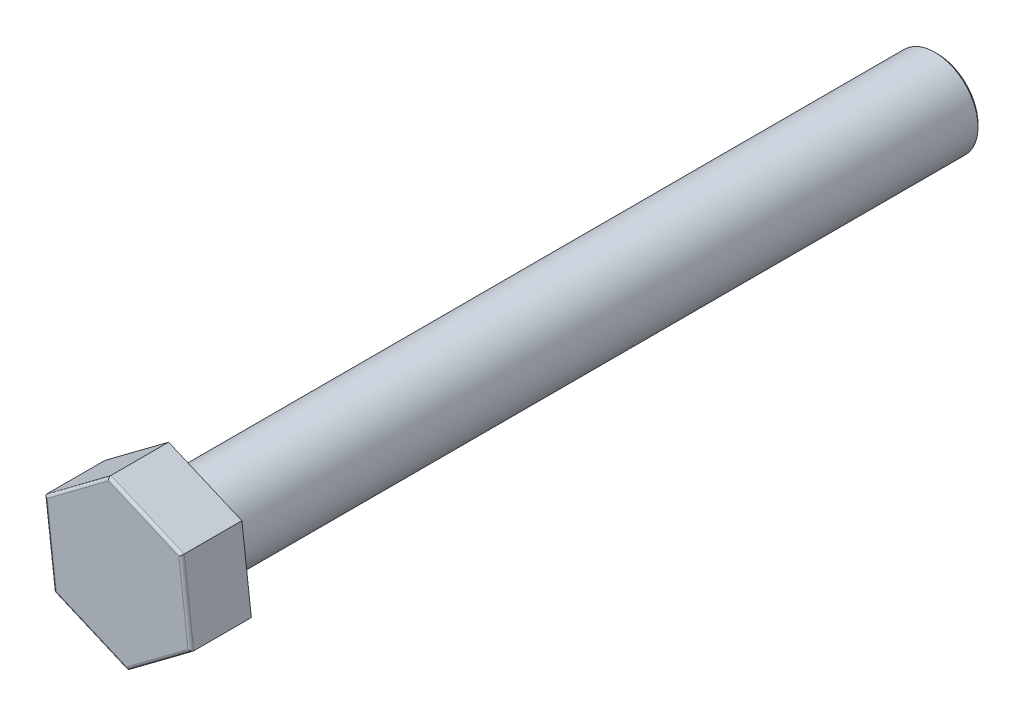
ISO-10303-21;
HEADER;
FILE_DESCRIPTION(('STEP AP214'),'2;1');
FILE_NAME('part.step','',(''),(''),'','','');
FILE_SCHEMA(('AUTOMOTIVE_DESIGN { 1 0 10303 214 1 1 1 1 }'));
ENDSEC;
DATA;
#1=APPLICATION_CONTEXT('core data for automotive mechanical design processes');
#2=APPLICATION_PROTOCOL_DEFINITION('international standard','automotive_design',2000,#1);
#3=PRODUCT_CONTEXT('',#1,'mechanical');
#4=PRODUCT('Part','Part','',(#3));
#5=PRODUCT_RELATED_PRODUCT_CATEGORY('part','',(#4));
#6=PRODUCT_DEFINITION_FORMATION('','',#4);
#7=PRODUCT_DEFINITION_CONTEXT('part definition',#1,'design');
#8=PRODUCT_DEFINITION('design','',#6,#7);
#9=PRODUCT_DEFINITION_SHAPE('','',#8);
#10=(LENGTH_UNIT() NAMED_UNIT(*) SI_UNIT(.MILLI.,.METRE.));
#11=(NAMED_UNIT(*) PLANE_ANGLE_UNIT() SI_UNIT($,.RADIAN.));
#12=(NAMED_UNIT(*) SI_UNIT($,.STERADIAN.) SOLID_ANGLE_UNIT());
#13=UNCERTAINTY_MEASURE_WITH_UNIT(LENGTH_MEASURE(1.E-05),#10,'distance_accuracy_value','');
#14=(GEOMETRIC_REPRESENTATION_CONTEXT(3) GLOBAL_UNCERTAINTY_ASSIGNED_CONTEXT((#13)) GLOBAL_UNIT_ASSIGNED_CONTEXT((#10,
#11,#12)) REPRESENTATION_CONTEXT('',''));
#15=CARTESIAN_POINT('',(0.,0.,0.));
#16=DIRECTION('',(0.,0.,1.));
#17=DIRECTION('',(1.,0.,0.));
#18=AXIS2_PLACEMENT_3D('',#15,#16,#17);
#19=CARTESIAN_POINT('',(0.,0.,69.85));
#20=DIRECTION('',(0.,0.,-1.));
#21=DIRECTION('',(-1.,0.,0.));
#22=AXIS2_PLACEMENT_3D('',#19,#20,#21);
#23=CYLINDRICAL_SURFACE('',#22,3.96875);
#24=CARTESIAN_POINT('',(0.,0.,0.253999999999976));
#25=DIRECTION('',(0.,0.,1.));
#26=DIRECTION('',(1.,0.,0.));
#27=AXIS2_PLACEMENT_3D('',#24,#25,#26);
#28=CIRCLE('',#27,3.96875);
#29=CARTESIAN_POINT('',(3.96875,0.,0.253999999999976));
#30=VERTEX_POINT('',#29);
#31=EDGE_CURVE('E39',#30,#30,#28,.T.);
#32=ORIENTED_EDGE('',*,*,#31,.T.);
#33=EDGE_LOOP('',(#32));
#34=FACE_BOUND('',#33,.T.);
#35=CARTESIAN_POINT('',(0.,0.,69.85));
#36=DIRECTION('',(0.,0.,1.));
#37=DIRECTION('',(1.,0.,0.));
#38=AXIS2_PLACEMENT_3D('',#35,#36,#37);
#39=CIRCLE('',#38,3.96875);
#40=CARTESIAN_POINT('',(3.96875,0.,69.85));
#41=VERTEX_POINT('',#40);
#42=EDGE_CURVE('E109',#41,#41,#39,.T.);
#43=ORIENTED_EDGE('',*,*,#42,.F.);
#44=EDGE_LOOP('',(#43));
#45=FACE_BOUND('',#44,.T.);
#46=ADVANCED_FACE('F31',(#34,#45),#23,.T.);
#47=CARTESIAN_POINT('',(0.,0.,0.));
#48=DIRECTION('',(0.,0.,1.));
#49=DIRECTION('',(1.,0.,0.));
#50=AXIS2_PLACEMENT_3D('',#47,#48,#49);
#51=PLANE('',#50);
#52=CARTESIAN_POINT('',(0.,0.,0.));
#53=DIRECTION('',(0.,0.,1.));
#54=DIRECTION('',(1.,0.,0.));
#55=AXIS2_PLACEMENT_3D('',#52,#53,#54);
#56=CIRCLE('',#55,3.71475000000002);
#57=CARTESIAN_POINT('',(3.71475000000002,0.,0.));
#58=VERTEX_POINT('',#57);
#59=EDGE_CURVE('E11',#58,#58,#56,.F.);
#60=ORIENTED_EDGE('',*,*,#59,.T.);
#61=EDGE_LOOP('',(#60));
#62=FACE_BOUND('',#61,.T.);
#63=ADVANCED_FACE('F202',(#62),#51,.F.);
#64=CARTESIAN_POINT('',(6.74016667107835,-2.88677788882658,69.85));
#65=DIRECTION('',(0.,0.,1.));
#66=DIRECTION('',(1.,0.,0.));
#67=AXIS2_PLACEMENT_3D('',#64,#65,#66);
#68=PLANE('',#67);
#69=DIRECTION('',(0.800576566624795,0.599230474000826,0.));
#70=VECTOR('',#69,1.);
#71=CARTESIAN_POINT('',(0.870060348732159,-7.28054450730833,69.85));
#72=LINE('',#71,#70);
#73=CARTESIAN_POINT('',(0.870060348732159,-7.28054450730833,69.85));
#74=VERTEX_POINT('',#73);
#75=CARTESIAN_POINT('',(6.74016667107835,-2.88677788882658,69.85));
#76=VERTEX_POINT('',#75);
#77=EDGE_CURVE('E117',#74,#76,#72,.T.);
#78=ORIENTED_EDGE('',*,*,#77,.F.);
#79=DIRECTION('',(0.919237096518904,-0.393704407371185,0.));
#80=VECTOR('',#79,1.);
#81=CARTESIAN_POINT('',(-5.87010632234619,-4.39376661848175,69.85));
#82=LINE('',#81,#80);
#83=CARTESIAN_POINT('',(-5.87010632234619,-4.39376661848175,69.85));
#84=VERTEX_POINT('',#83);
#85=EDGE_CURVE('E139',#84,#74,#82,.T.);
#86=ORIENTED_EDGE('',*,*,#85,.F.);
#87=DIRECTION('',(0.118660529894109,-0.992934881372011,0.));
#88=VECTOR('',#87,1.);
#89=CARTESIAN_POINT('',(-6.74016667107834,2.88677788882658,69.85));
#90=LINE('',#89,#88);
#91=CARTESIAN_POINT('',(-6.74016667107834,2.88677788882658,69.85));
#92=VERTEX_POINT('',#91);
#93=EDGE_CURVE('E136',#92,#84,#90,.T.);
#94=ORIENTED_EDGE('',*,*,#93,.F.);
#95=DIRECTION('',(-0.800576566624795,-0.599230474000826,0.));
#96=VECTOR('',#95,1.);
#97=CARTESIAN_POINT('',(-0.87006034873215,7.28054450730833,69.85));
#98=LINE('',#97,#96);
#99=CARTESIAN_POINT('',(-0.87006034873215,7.28054450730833,69.85));
#100=VERTEX_POINT('',#99);
#101=EDGE_CURVE('E133',#100,#92,#98,.T.);
#102=ORIENTED_EDGE('',*,*,#101,.F.);
#103=DIRECTION('',(-0.919237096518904,0.393704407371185,0.));
#104=VECTOR('',#103,1.);
#105=CARTESIAN_POINT('',(5.87010632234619,4.39376661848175,69.85));
#106=LINE('',#105,#104);
#107=CARTESIAN_POINT('',(5.87010632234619,4.39376661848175,69.85));
#108=VERTEX_POINT('',#107);
#109=EDGE_CURVE('E120',#108,#100,#106,.T.);
#110=ORIENTED_EDGE('',*,*,#109,.F.);
#111=DIRECTION('',(-0.118660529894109,0.992934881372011,0.));
#112=VECTOR('',#111,1.);
#113=CARTESIAN_POINT('',(6.74016667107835,-2.88677788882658,69.85));
#114=LINE('',#113,#112);
#115=EDGE_CURVE('E104',#76,#108,#114,.T.);
#116=ORIENTED_EDGE('',*,*,#115,.F.);
#117=EDGE_LOOP('',(#78,#86,#94,#102,#110,#116));
#118=FACE_BOUND('',#117,.T.);
#119=ORIENTED_EDGE('',*,*,#42,.T.);
#120=EDGE_LOOP('',(#119));
#121=FACE_BOUND('',#120,.T.);
#122=ADVANCED_FACE('F114',(#118,#121),#68,.F.);
#123=CARTESIAN_POINT('',(0.870060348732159,-7.28054450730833,75.40625));
#124=DIRECTION('',(-0.599230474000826,0.800576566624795,0.));
#125=DIRECTION('',(-0.800576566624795,-0.599230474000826,0.));
#126=AXIS2_PLACEMENT_3D('',#123,#124,#125);
#127=PLANE('',#126);
#128=DIRECTION('',(0.,0.,-1.));
#129=VECTOR('',#128,1.);
#130=CARTESIAN_POINT('',(6.74016667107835,-2.88677788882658,75.40625));
#131=LINE('',#130,#129);
#132=CARTESIAN_POINT('',(6.74016667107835,-2.88677788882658,75.15225));
#133=VERTEX_POINT('',#132);
#134=EDGE_CURVE('E101',#133,#76,#131,.T.);
#135=ORIENTED_EDGE('',*,*,#134,.F.);
#136=DIRECTION('',(0.800576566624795,0.599230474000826,0.));
#137=VECTOR('',#136,1.);
#138=CARTESIAN_POINT('',(0.870060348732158,-7.28054450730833,75.15225));
#139=LINE('',#138,#137);
#140=CARTESIAN_POINT('',(0.870060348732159,-7.28054450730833,75.15225));
#141=VERTEX_POINT('',#140);
#142=EDGE_CURVE('E171',#133,#141,#139,.F.);
#143=ORIENTED_EDGE('',*,*,#142,.T.);
#144=DIRECTION('',(0.,0.,-1.));
#145=VECTOR('',#144,1.);
#146=CARTESIAN_POINT('',(0.870060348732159,-7.28054450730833,75.40625));
#147=LINE('',#146,#145);
#148=EDGE_CURVE('E124',#141,#74,#147,.T.);
#149=ORIENTED_EDGE('',*,*,#148,.T.);
#150=ORIENTED_EDGE('',*,*,#77,.T.);
#151=EDGE_LOOP('',(#135,#143,#149,#150));
#152=FACE_BOUND('',#151,.T.);
#153=ADVANCED_FACE('F122',(#152),#127,.F.);
#154=CARTESIAN_POINT('',(6.74016667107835,-2.88677788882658,75.40625));
#155=DIRECTION('',(-0.992934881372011,-0.118660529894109,0.));
#156=DIRECTION('',(0.118660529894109,-0.992934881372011,0.));
#157=AXIS2_PLACEMENT_3D('',#154,#155,#156);
#158=PLANE('',#157);
#159=DIRECTION('',(0.,0.,-1.));
#160=VECTOR('',#159,1.);
#161=CARTESIAN_POINT('',(5.87010632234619,4.39376661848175,75.40625));
#162=LINE('',#161,#160);
#163=CARTESIAN_POINT('',(5.87010632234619,4.39376661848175,75.15225));
#164=VERTEX_POINT('',#163);
#165=EDGE_CURVE('E110',#164,#108,#162,.T.);
#166=ORIENTED_EDGE('',*,*,#165,.F.);
#167=DIRECTION('',(-0.118660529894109,0.992934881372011,0.));
#168=VECTOR('',#167,1.);
#169=CARTESIAN_POINT('',(6.74016667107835,-2.88677788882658,75.15225));
#170=LINE('',#169,#168);
#171=EDGE_CURVE('E53',#164,#133,#170,.F.);
#172=ORIENTED_EDGE('',*,*,#171,.T.);
#173=ORIENTED_EDGE('',*,*,#134,.T.);
#174=ORIENTED_EDGE('',*,*,#115,.T.);
#175=EDGE_LOOP('',(#166,#172,#173,#174));
#176=FACE_BOUND('',#175,.T.);
#177=ADVANCED_FACE('F103',(#176),#158,.F.);
#178=CARTESIAN_POINT('',(5.87010632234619,4.39376661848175,75.40625));
#179=DIRECTION('',(-0.393704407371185,-0.919237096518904,0.));
#180=DIRECTION('',(0.919237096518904,-0.393704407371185,0.));
#181=AXIS2_PLACEMENT_3D('',#178,#179,#180);
#182=PLANE('',#181);
#183=DIRECTION('',(0.,0.,-1.));
#184=VECTOR('',#183,1.);
#185=CARTESIAN_POINT('',(-0.87006034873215,7.28054450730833,75.40625));
#186=LINE('',#185,#184);
#187=CARTESIAN_POINT('',(-0.87006034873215,7.28054450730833,75.15225));
#188=VERTEX_POINT('',#187);
#189=EDGE_CURVE('E146',#188,#100,#186,.T.);
#190=ORIENTED_EDGE('',*,*,#189,.F.);
#191=DIRECTION('',(-0.919237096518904,0.393704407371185,0.));
#192=VECTOR('',#191,1.);
#193=CARTESIAN_POINT('',(5.8701063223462,4.39376661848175,75.15225));
#194=LINE('',#193,#192);
#195=EDGE_CURVE('E46',#188,#164,#194,.F.);
#196=ORIENTED_EDGE('',*,*,#195,.T.);
#197=ORIENTED_EDGE('',*,*,#165,.T.);
#198=ORIENTED_EDGE('',*,*,#109,.T.);
#199=EDGE_LOOP('',(#190,#196,#197,#198));
#200=FACE_BOUND('',#199,.T.);
#201=ADVANCED_FACE('F251',(#200),#182,.F.);
#202=CARTESIAN_POINT('',(-0.87006034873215,7.28054450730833,75.40625));
#203=DIRECTION('',(0.599230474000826,-0.800576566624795,0.));
#204=DIRECTION('',(0.800576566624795,0.599230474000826,0.));
#205=AXIS2_PLACEMENT_3D('',#202,#203,#204);
#206=PLANE('',#205);
#207=DIRECTION('',(0.,0.,-1.));
#208=VECTOR('',#207,1.);
#209=CARTESIAN_POINT('',(-6.74016667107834,2.88677788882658,75.40625));
#210=LINE('',#209,#208);
#211=CARTESIAN_POINT('',(-6.74016667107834,2.88677788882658,75.15225));
#212=VERTEX_POINT('',#211);
#213=EDGE_CURVE('E144',#212,#92,#210,.T.);
#214=ORIENTED_EDGE('',*,*,#213,.F.);
#215=DIRECTION('',(-0.800576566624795,-0.599230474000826,0.));
#216=VECTOR('',#215,1.);
#217=CARTESIAN_POINT('',(-0.87006034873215,7.28054450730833,75.15225));
#218=LINE('',#217,#216);
#219=EDGE_CURVE('E164',#212,#188,#218,.F.);
#220=ORIENTED_EDGE('',*,*,#219,.T.);
#221=ORIENTED_EDGE('',*,*,#189,.T.);
#222=ORIENTED_EDGE('',*,*,#101,.T.);
#223=EDGE_LOOP('',(#214,#220,#221,#222));
#224=FACE_BOUND('',#223,.T.);
#225=ADVANCED_FACE('F249',(#224),#206,.F.);
#226=CARTESIAN_POINT('',(-6.74016667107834,2.88677788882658,75.40625));
#227=DIRECTION('',(0.992934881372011,0.118660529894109,0.));
#228=DIRECTION('',(-0.118660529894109,0.992934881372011,0.));
#229=AXIS2_PLACEMENT_3D('',#226,#227,#228);
#230=PLANE('',#229);
#231=DIRECTION('',(0.,0.,-1.));
#232=VECTOR('',#231,1.);
#233=CARTESIAN_POINT('',(-5.87010632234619,-4.39376661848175,75.40625));
#234=LINE('',#233,#232);
#235=CARTESIAN_POINT('',(-5.87010632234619,-4.39376661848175,75.15225));
#236=VERTEX_POINT('',#235);
#237=EDGE_CURVE('E142',#236,#84,#234,.T.);
#238=ORIENTED_EDGE('',*,*,#237,.F.);
#239=DIRECTION('',(0.118660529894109,-0.992934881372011,0.));
#240=VECTOR('',#239,1.);
#241=CARTESIAN_POINT('',(-6.74016667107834,2.88677788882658,75.15225));
#242=LINE('',#241,#240);
#243=EDGE_CURVE('E167',#236,#212,#242,.F.);
#244=ORIENTED_EDGE('',*,*,#243,.T.);
#245=ORIENTED_EDGE('',*,*,#213,.T.);
#246=ORIENTED_EDGE('',*,*,#93,.T.);
#247=EDGE_LOOP('',(#238,#244,#245,#246));
#248=FACE_BOUND('',#247,.T.);
#249=ADVANCED_FACE('F245',(#248),#230,.F.);
#250=CARTESIAN_POINT('',(-5.87010632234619,-4.39376661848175,75.40625));
#251=DIRECTION('',(0.393704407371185,0.919237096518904,0.));
#252=DIRECTION('',(-0.919237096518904,0.393704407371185,0.));
#253=AXIS2_PLACEMENT_3D('',#250,#251,#252);
#254=PLANE('',#253);
#255=ORIENTED_EDGE('',*,*,#148,.F.);
#256=DIRECTION('',(0.919237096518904,-0.393704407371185,0.));
#257=VECTOR('',#256,1.);
#258=CARTESIAN_POINT('',(-5.87010632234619,-4.39376661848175,75.15225));
#259=LINE('',#258,#257);
#260=EDGE_CURVE('E169',#141,#236,#259,.F.);
#261=ORIENTED_EDGE('',*,*,#260,.T.);
#262=ORIENTED_EDGE('',*,*,#237,.T.);
#263=ORIENTED_EDGE('',*,*,#85,.T.);
#264=EDGE_LOOP('',(#255,#261,#262,#263));
#265=FACE_BOUND('',#264,.T.);
#266=ADVANCED_FACE('F232',(#265),#254,.F.);
#267=CARTESIAN_POINT('',(6.74016667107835,-2.88677788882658,75.40625));
#268=DIRECTION('',(0.,0.,1.));
#269=DIRECTION('',(1.,0.,0.));
#270=AXIS2_PLACEMENT_3D('',#267,#268,#269);
#271=PLANE('',#270);
#272=DIRECTION('',(-0.919237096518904,0.393704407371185,0.));
#273=VECTOR('',#272,1.);
#274=CARTESIAN_POINT('',(-0.97006126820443,7.04705828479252,75.40625));
#275=LINE('',#274,#273);
#276=CARTESIAN_POINT('',(5.63530206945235,4.21801595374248,75.40625));
#277=VERTEX_POINT('',#276);
#278=CARTESIAN_POINT('',(-0.835257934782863,6.98932272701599,75.40625));
#279=VERTEX_POINT('',#278);
#280=EDGE_CURVE('E151',#277,#279,#275,.T.);
#281=ORIENTED_EDGE('',*,*,#280,.T.);
#282=DIRECTION('',(-0.800576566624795,-0.599230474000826,0.));
#283=VECTOR('',#282,1.);
#284=CARTESIAN_POINT('',(-6.58796213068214,2.68343144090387,75.40625));
#285=LINE('',#284,#283);
#286=CARTESIAN_POINT('',(-6.47056000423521,2.77130677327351,75.40625));
#287=VERTEX_POINT('',#286);
#288=EDGE_CURVE('E161',#279,#287,#285,.T.);
#289=ORIENTED_EDGE('',*,*,#288,.T.);
#290=DIRECTION('',(0.118660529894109,-0.992934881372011,0.));
#291=VECTOR('',#290,1.);
#292=CARTESIAN_POINT('',(-5.6179008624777,-4.36362684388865,75.40625));
#293=LINE('',#292,#291);
#294=CARTESIAN_POINT('',(-5.63530206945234,-4.21801595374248,75.40625));
#295=VERTEX_POINT('',#294);
#296=EDGE_CURVE('E159',#287,#295,#293,.T.);
#297=ORIENTED_EDGE('',*,*,#296,.T.);
#298=DIRECTION('',(0.919237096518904,-0.393704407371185,0.));
#299=VECTOR('',#298,1.);
#300=CARTESIAN_POINT('',(0.970061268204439,-7.04705828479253,75.40625));
#301=LINE('',#300,#299);
#302=CARTESIAN_POINT('',(0.835257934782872,-6.989322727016,75.40625));
#303=VERTEX_POINT('',#302);
#304=EDGE_CURVE('E157',#295,#303,#301,.T.);
#305=ORIENTED_EDGE('',*,*,#304,.T.);
#306=DIRECTION('',(0.800576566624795,0.599230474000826,0.));
#307=VECTOR('',#306,1.);
#308=CARTESIAN_POINT('',(6.58796213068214,-2.68343144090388,75.40625));
#309=LINE('',#308,#307);
#310=CARTESIAN_POINT('',(6.47056000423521,-2.77130677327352,75.40625));
#311=VERTEX_POINT('',#310);
#312=EDGE_CURVE('E155',#303,#311,#309,.T.);
#313=ORIENTED_EDGE('',*,*,#312,.T.);
#314=DIRECTION('',(-0.118660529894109,0.992934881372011,0.));
#315=VECTOR('',#314,1.);
#316=CARTESIAN_POINT('',(5.6179008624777,4.36362684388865,75.40625));
#317=LINE('',#316,#315);
#318=EDGE_CURVE('E153',#311,#277,#317,.T.);
#319=ORIENTED_EDGE('',*,*,#318,.T.);
#320=EDGE_LOOP('',(#281,#289,#297,#305,#313,#319));
#321=FACE_BOUND('',#320,.T.);
#322=ADVANCED_FACE('F227',(#321),#271,.T.);
#323=CARTESIAN_POINT('',(6.58796213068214,-2.68343144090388,75.15225));
#324=DIRECTION('',(-0.800576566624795,-0.599230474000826,0.));
#325=DIRECTION('',(0.599230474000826,-0.800576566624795,0.));
#326=AXIS2_PLACEMENT_3D('',#323,#324,#325);
#327=CYLINDRICAL_SURFACE('',#326,0.254);
#328=CARTESIAN_POINT('',(0.835257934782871,-6.989322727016,75.15225));
#329=DIRECTION('',(-0.992934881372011,-0.118660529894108,0.));
#330=DIRECTION('',(0.118660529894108,-0.992934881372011,0.));
#331=AXIS2_PLACEMENT_3D('',#328,#329,#330);
#332=ELLIPSE('',#331,0.29329393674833,0.254);
#333=EDGE_CURVE('E129',#141,#303,#332,.T.);
#334=ORIENTED_EDGE('',*,*,#333,.F.);
#335=ORIENTED_EDGE('',*,*,#142,.F.);
#336=CARTESIAN_POINT('',(6.47056000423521,-2.77130677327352,75.15225));
#337=DIRECTION('',(-0.393704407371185,-0.919237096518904,0.));
#338=DIRECTION('',(0.919237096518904,-0.393704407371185,0.));
#339=AXIS2_PLACEMENT_3D('',#336,#337,#338);
#340=ELLIPSE('',#339,0.29329393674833,0.254);
#341=EDGE_CURVE('E126',#311,#133,#340,.F.);
#342=ORIENTED_EDGE('',*,*,#341,.F.);
#343=ORIENTED_EDGE('',*,*,#312,.F.);
#344=EDGE_LOOP('',(#334,#335,#342,#343));
#345=FACE_BOUND('',#344,.T.);
#346=ADVANCED_FACE('F224',(#345),#327,.T.);
#347=CARTESIAN_POINT('',(6.48796121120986,-2.91691766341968,75.15225));
#348=DIRECTION('',(0.118660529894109,-0.992934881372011,0.));
#349=DIRECTION('',(0.992934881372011,0.118660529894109,0.));
#350=AXIS2_PLACEMENT_3D('',#347,#348,#349);
#351=CYLINDRICAL_SURFACE('',#350,0.254);
#352=ORIENTED_EDGE('',*,*,#341,.T.);
#353=ORIENTED_EDGE('',*,*,#171,.F.);
#354=CARTESIAN_POINT('',(5.63530206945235,4.21801595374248,75.15225));
#355=DIRECTION('',(0.599230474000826,-0.800576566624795,0.));
#356=DIRECTION('',(0.800576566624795,0.599230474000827,0.));
#357=AXIS2_PLACEMENT_3D('',#354,#355,#356);
#358=ELLIPSE('',#357,0.29329393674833,0.254);
#359=EDGE_CURVE('E182',#277,#164,#358,.F.);
#360=ORIENTED_EDGE('',*,*,#359,.F.);
#361=ORIENTED_EDGE('',*,*,#318,.F.);
#362=EDGE_LOOP('',(#352,#353,#360,#361));
#363=FACE_BOUND('',#362,.T.);
#364=ADVANCED_FACE('F221',(#363),#351,.T.);
#365=CARTESIAN_POINT('',(4.34014460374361,-8.49044722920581,75.15225));
#366=DIRECTION('',(-0.919237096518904,0.393704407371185,0.));
#367=DIRECTION('',(-0.393704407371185,-0.919237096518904,0.));
#368=AXIS2_PLACEMENT_3D('',#365,#366,#367);
#369=CYLINDRICAL_SURFACE('',#368,0.254);
#370=ORIENTED_EDGE('',*,*,#333,.T.);
#371=ORIENTED_EDGE('',*,*,#304,.F.);
#372=CARTESIAN_POINT('',(-5.63530206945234,-4.21801595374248,75.15225));
#373=DIRECTION('',(-0.599230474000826,0.800576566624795,0.));
#374=DIRECTION('',(-0.800576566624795,-0.599230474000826,0.));
#375=AXIS2_PLACEMENT_3D('',#372,#373,#374);
#376=ELLIPSE('',#375,0.29329393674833,0.254);
#377=EDGE_CURVE('E179',#236,#295,#376,.T.);
#378=ORIENTED_EDGE('',*,*,#377,.F.);
#379=ORIENTED_EDGE('',*,*,#260,.F.);
#380=EDGE_LOOP('',(#370,#371,#378,#379));
#381=FACE_BOUND('',#380,.T.);
#382=ADVANCED_FACE('F217',(#381),#369,.T.);
#383=CARTESIAN_POINT('',(9.14018873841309,2.71689145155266,75.15225));
#384=DIRECTION('',(0.919237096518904,-0.393704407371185,0.));
#385=DIRECTION('',(0.393704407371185,0.919237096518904,0.));
#386=AXIS2_PLACEMENT_3D('',#383,#384,#385);
#387=CYLINDRICAL_SURFACE('',#386,0.254);
#388=ORIENTED_EDGE('',*,*,#359,.T.);
#389=ORIENTED_EDGE('',*,*,#195,.F.);
#390=CARTESIAN_POINT('',(-0.835257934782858,6.98932272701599,75.15225));
#391=DIRECTION('',(0.992934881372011,0.118660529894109,0.));
#392=DIRECTION('',(0.118660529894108,-0.992934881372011,0.));
#393=AXIS2_PLACEMENT_3D('',#390,#391,#392);
#394=ELLIPSE('',#393,0.29329393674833,0.254);
#395=EDGE_CURVE('E177',#279,#188,#394,.F.);
#396=ORIENTED_EDGE('',*,*,#395,.F.);
#397=ORIENTED_EDGE('',*,*,#280,.F.);
#398=EDGE_LOOP('',(#388,#389,#396,#397));
#399=FACE_BOUND('',#398,.T.);
#400=ADVANCED_FACE('F213',(#399),#387,.T.);
#401=CARTESIAN_POINT('',(-5.6179008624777,-4.36362684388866,75.15225));
#402=DIRECTION('',(-0.118660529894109,0.992934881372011,0.));
#403=DIRECTION('',(-0.992934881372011,-0.118660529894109,0.));
#404=AXIS2_PLACEMENT_3D('',#401,#402,#403);
#405=CYLINDRICAL_SURFACE('',#404,0.254);
#406=ORIENTED_EDGE('',*,*,#377,.T.);
#407=ORIENTED_EDGE('',*,*,#296,.F.);
#408=CARTESIAN_POINT('',(-6.47056000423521,2.77130677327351,75.15225));
#409=DIRECTION('',(0.393704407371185,0.919237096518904,0.));
#410=DIRECTION('',(-0.919237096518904,0.393704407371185,0.));
#411=AXIS2_PLACEMENT_3D('',#408,#409,#410);
#412=ELLIPSE('',#411,0.29329393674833,0.254);
#413=EDGE_CURVE('E175',#212,#287,#412,.T.);
#414=ORIENTED_EDGE('',*,*,#413,.F.);
#415=ORIENTED_EDGE('',*,*,#243,.F.);
#416=EDGE_LOOP('',(#406,#407,#414,#415));
#417=FACE_BOUND('',#416,.T.);
#418=ADVANCED_FACE('F197',(#417),#405,.T.);
#419=CARTESIAN_POINT('',(-0.71785580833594,7.07719805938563,75.15225));
#420=DIRECTION('',(0.800576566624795,0.599230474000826,0.));
#421=DIRECTION('',(-0.599230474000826,0.800576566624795,0.));
#422=AXIS2_PLACEMENT_3D('',#419,#420,#421);
#423=CYLINDRICAL_SURFACE('',#422,0.254);
#424=ORIENTED_EDGE('',*,*,#395,.T.);
#425=ORIENTED_EDGE('',*,*,#219,.F.);
#426=ORIENTED_EDGE('',*,*,#413,.T.);
#427=ORIENTED_EDGE('',*,*,#288,.F.);
#428=EDGE_LOOP('',(#424,#425,#426,#427));
#429=FACE_BOUND('',#428,.T.);
#430=ADVANCED_FACE('F192',(#429),#423,.T.);
#431=CARTESIAN_POINT('',(0.,0.,0.253999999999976));
#432=DIRECTION('',(0.,0.,1.));
#433=DIRECTION('',(1.,0.,0.));
#434=AXIS2_PLACEMENT_3D('',#431,#432,#433);
#435=CONICAL_SURFACE('',#434,3.96875,0.785398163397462);
#436=ORIENTED_EDGE('',*,*,#59,.F.);
#437=EDGE_LOOP('',(#436));
#438=FACE_BOUND('',#437,.T.);
#439=ORIENTED_EDGE('',*,*,#31,.F.);
#440=EDGE_LOOP('',(#439));
#441=FACE_BOUND('',#440,.T.);
#442=ADVANCED_FACE('F33',(#438,#441),#435,.T.);
#443=CLOSED_SHELL('',(#46,#63,#122,#153,#177,#201,#225,#249,#266,#322,#346,#364,#382,#400,#418,
#430,#442));
#444=MANIFOLD_SOLID_BREP('B2',#443);
#445=ADVANCED_BREP_SHAPE_REPRESENTATION('',(#18,#444),#14);
#446=SHAPE_DEFINITION_REPRESENTATION(#9,#445);
ENDSEC;
END-ISO-10303-21;
